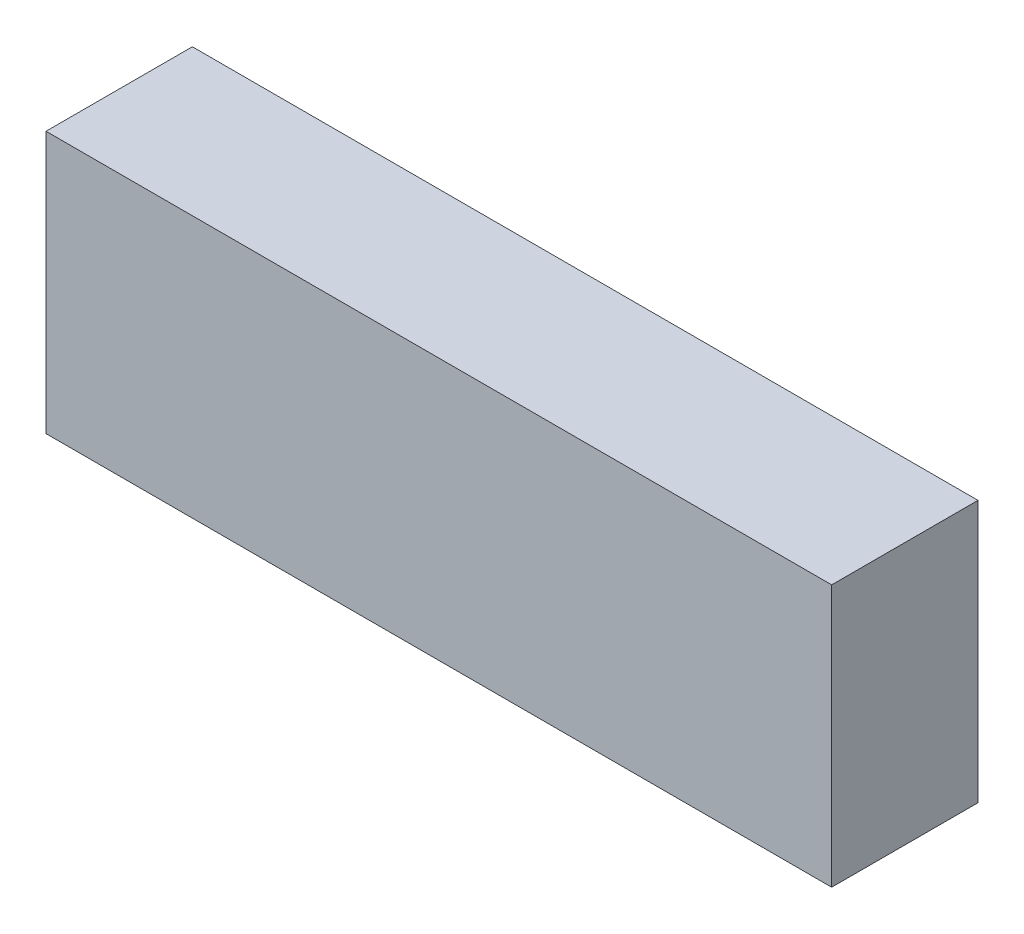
from build123d import *

# Parameters (mm, degrees)
SKETCH1_W      = 30
SKETCH1_H      = 10
EXTRUDE1_DEPTH = 5.588


with BuildPart() as part:
    # Sketch1 → Extrude1 (new body)
    with BuildSketch(Plane.XY):
        Rectangle(SKETCH1_W, SKETCH1_H)
    extrude(amount=EXTRUDE1_DEPTH)


solid = part.part
